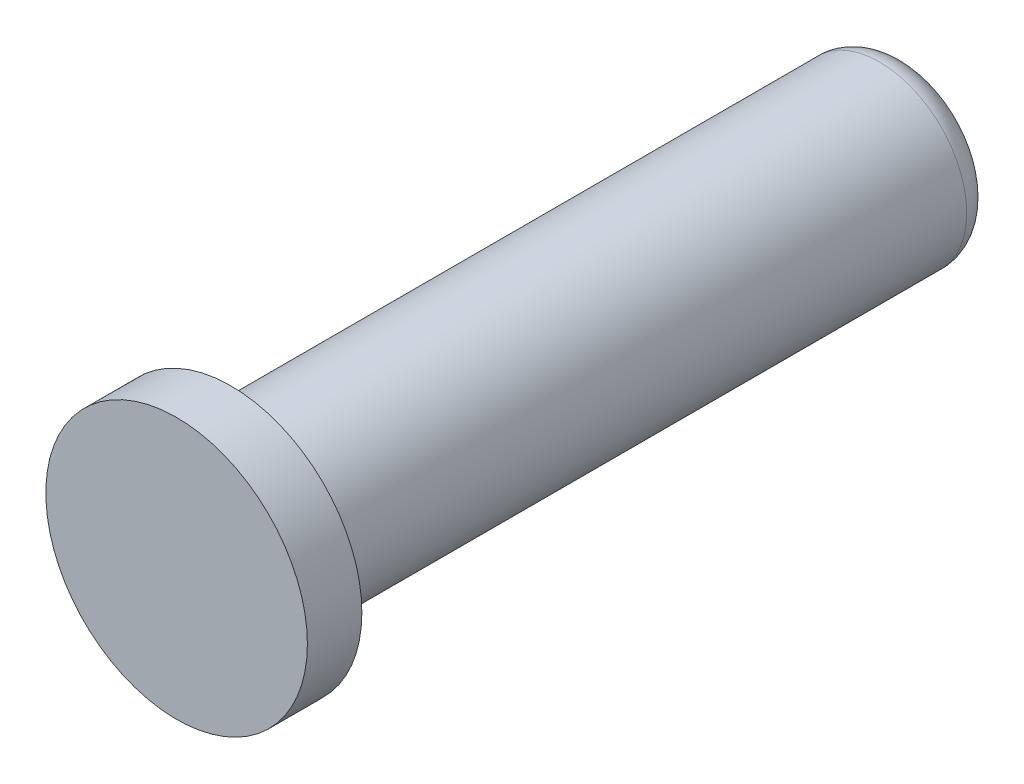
ISO-10303-21;
HEADER;
FILE_DESCRIPTION(('STEP AP214'),'2;1');
FILE_NAME('part.step','',(''),(''),'','','');
FILE_SCHEMA(('AUTOMOTIVE_DESIGN { 1 0 10303 214 1 1 1 1 }'));
ENDSEC;
DATA;
#1=APPLICATION_CONTEXT('core data for automotive mechanical design processes');
#2=APPLICATION_PROTOCOL_DEFINITION('international standard','automotive_design',2000,#1);
#3=PRODUCT_CONTEXT('',#1,'mechanical');
#4=PRODUCT('Part','Part','',(#3));
#5=PRODUCT_RELATED_PRODUCT_CATEGORY('part','',(#4));
#6=PRODUCT_DEFINITION_FORMATION('','',#4);
#7=PRODUCT_DEFINITION_CONTEXT('part definition',#1,'design');
#8=PRODUCT_DEFINITION('design','',#6,#7);
#9=PRODUCT_DEFINITION_SHAPE('','',#8);
#10=(LENGTH_UNIT() NAMED_UNIT(*) SI_UNIT(.MILLI.,.METRE.));
#11=(NAMED_UNIT(*) PLANE_ANGLE_UNIT() SI_UNIT($,.RADIAN.));
#12=(NAMED_UNIT(*) SI_UNIT($,.STERADIAN.) SOLID_ANGLE_UNIT());
#13=UNCERTAINTY_MEASURE_WITH_UNIT(LENGTH_MEASURE(1.E-05),#10,'distance_accuracy_value','');
#14=(GEOMETRIC_REPRESENTATION_CONTEXT(3) GLOBAL_UNCERTAINTY_ASSIGNED_CONTEXT((#13)) GLOBAL_UNIT_ASSIGNED_CONTEXT((#10,
#11,#12)) REPRESENTATION_CONTEXT('',''));
#15=CARTESIAN_POINT('',(0.,0.,0.));
#16=DIRECTION('',(0.,0.,1.));
#17=DIRECTION('',(1.,0.,0.));
#18=AXIS2_PLACEMENT_3D('',#15,#16,#17);
#19=CARTESIAN_POINT('',(0.,0.,0.));
#20=DIRECTION('',(0.,0.,-1.));
#21=DIRECTION('',(-1.,0.,0.));
#22=AXIS2_PLACEMENT_3D('',#19,#20,#21);
#23=PLANE('',#22);
#24=CARTESIAN_POINT('',(0.,0.,0.));
#25=DIRECTION('',(0.,0.,1.));
#26=DIRECTION('',(1.,0.,0.));
#27=AXIS2_PLACEMENT_3D('',#24,#25,#26);
#28=CIRCLE('',#27,12.);
#29=CARTESIAN_POINT('',(12.,0.,0.));
#30=VERTEX_POINT('',#29);
#31=EDGE_CURVE('E12',#30,#30,#28,.T.);
#32=ORIENTED_EDGE('',*,*,#31,.T.);
#33=EDGE_LOOP('',(#32));
#34=FACE_BOUND('',#33,.T.);
#35=ADVANCED_FACE('F33',(#34),#23,.F.);
#36=CARTESIAN_POINT('',(0.,0.,0.));
#37=DIRECTION('',(0.,0.,1.));
#38=DIRECTION('',(1.,0.,0.));
#39=AXIS2_PLACEMENT_3D('',#36,#37,#38);
#40=CYLINDRICAL_SURFACE('',#39,12.);
#41=ORIENTED_EDGE('',*,*,#31,.F.);
#42=EDGE_LOOP('',(#41));
#43=FACE_BOUND('',#42,.T.);
#44=CARTESIAN_POINT('',(0.,0.,-5.));
#45=DIRECTION('',(0.,0.,1.));
#46=DIRECTION('',(1.,0.,0.));
#47=AXIS2_PLACEMENT_3D('',#44,#45,#46);
#48=CIRCLE('',#47,12.);
#49=CARTESIAN_POINT('',(12.,0.,-5.));
#50=VERTEX_POINT('',#49);
#51=EDGE_CURVE('E39',#50,#50,#48,.T.);
#52=ORIENTED_EDGE('',*,*,#51,.T.);
#53=EDGE_LOOP('',(#52));
#54=FACE_BOUND('',#53,.T.);
#55=ADVANCED_FACE('F70',(#43,#54),#40,.T.);
#56=CARTESIAN_POINT('',(0.,12.,-5.));
#57=DIRECTION('',(0.,0.,1.));
#58=DIRECTION('',(1.,0.,0.));
#59=AXIS2_PLACEMENT_3D('',#56,#57,#58);
#60=PLANE('',#59);
#61=ORIENTED_EDGE('',*,*,#51,.F.);
#62=EDGE_LOOP('',(#61));
#63=FACE_BOUND('',#62,.T.);
#64=CARTESIAN_POINT('',(0.,0.,-5.));
#65=DIRECTION('',(0.,0.,1.));
#66=DIRECTION('',(1.,0.,0.));
#67=AXIS2_PLACEMENT_3D('',#64,#65,#66);
#68=CIRCLE('',#67,8.);
#69=CARTESIAN_POINT('',(8.,0.,-5.));
#70=VERTEX_POINT('',#69);
#71=EDGE_CURVE('E65',#70,#70,#68,.T.);
#72=ORIENTED_EDGE('',*,*,#71,.T.);
#73=EDGE_LOOP('',(#72));
#74=FACE_BOUND('',#73,.T.);
#75=ADVANCED_FACE('F72',(#63,#74),#60,.F.);
#76=CARTESIAN_POINT('',(0.,0.,0.));
#77=DIRECTION('',(0.,0.,1.));
#78=DIRECTION('',(1.,0.,0.));
#79=AXIS2_PLACEMENT_3D('',#76,#77,#78);
#80=CYLINDRICAL_SURFACE('',#79,8.);
#81=ORIENTED_EDGE('',*,*,#71,.F.);
#82=EDGE_LOOP('',(#81));
#83=FACE_BOUND('',#82,.T.);
#84=CARTESIAN_POINT('',(0.,0.,-64.5));
#85=DIRECTION('',(0.,0.,1.));
#86=DIRECTION('',(1.,0.,0.));
#87=AXIS2_PLACEMENT_3D('',#84,#85,#86);
#88=CIRCLE('',#87,8.);
#89=CARTESIAN_POINT('',(8.,0.,-64.5));
#90=VERTEX_POINT('',#89);
#91=EDGE_CURVE('E62',#90,#90,#88,.T.);
#92=ORIENTED_EDGE('',*,*,#91,.T.);
#93=EDGE_LOOP('',(#92));
#94=FACE_BOUND('',#93,.T.);
#95=ADVANCED_FACE('F75',(#83,#94),#80,.T.);
#96=CARTESIAN_POINT('',(0.,0.,-64.5));
#97=DIRECTION('',(0.,0.,1.));
#98=DIRECTION('',(1.,0.,0.));
#99=AXIS2_PLACEMENT_3D('',#96,#97,#98);
#100=TOROIDAL_SURFACE('',#99,5.5,2.5);
#101=ORIENTED_EDGE('',*,*,#91,.F.);
#102=EDGE_LOOP('',(#101));
#103=FACE_BOUND('',#102,.T.);
#104=CARTESIAN_POINT('',(0.,0.,-67.));
#105=DIRECTION('',(0.,0.,1.));
#106=DIRECTION('',(1.,0.,0.));
#107=AXIS2_PLACEMENT_3D('',#104,#105,#106);
#108=CIRCLE('',#107,5.5);
#109=CARTESIAN_POINT('',(5.5,0.,-67.));
#110=VERTEX_POINT('',#109);
#111=EDGE_CURVE('E59',#110,#110,#108,.T.);
#112=ORIENTED_EDGE('',*,*,#111,.T.);
#113=EDGE_LOOP('',(#112));
#114=FACE_BOUND('',#113,.T.);
#115=ADVANCED_FACE('F81',(#103,#114),#100,.T.);
#116=CARTESIAN_POINT('',(0.,5.5,-67.));
#117=DIRECTION('',(0.,0.,1.));
#118=DIRECTION('',(1.,0.,0.));
#119=AXIS2_PLACEMENT_3D('',#116,#117,#118);
#120=PLANE('',#119);
#121=CARTESIAN_POINT('',(0.,0.,-67.));
#122=DIRECTION('',(0.,0.,-1.));
#123=DIRECTION('',(0.,1.,0.));
#124=AXIS2_PLACEMENT_3D('',#121,#122,#123);
#125=CIRCLE('',#124,3.);
#126=CARTESIAN_POINT('',(0.,3.00000000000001,-67.));
#127=VERTEX_POINT('',#126);
#128=EDGE_CURVE('E54',#127,#127,#125,.T.);
#129=ORIENTED_EDGE('',*,*,#128,.F.);
#130=EDGE_LOOP('',(#129));
#131=FACE_BOUND('',#130,.T.);
#132=ORIENTED_EDGE('',*,*,#111,.F.);
#133=EDGE_LOOP('',(#132));
#134=FACE_BOUND('',#133,.T.);
#135=ADVANCED_FACE('F87',(#131,#134),#120,.F.);
#136=CARTESIAN_POINT('',(0.,0.,-67.));
#137=DIRECTION('',(0.,0.,-1.));
#138=DIRECTION('',(0.,1.,0.));
#139=AXIS2_PLACEMENT_3D('',#136,#137,#138);
#140=CONICAL_SURFACE('',#139,3.,0.785398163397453);
#141=CARTESIAN_POINT('',(0.,0.,-66.5));
#142=DIRECTION('',(0.,0.,-1.));
#143=DIRECTION('',(0.,1.,0.));
#144=AXIS2_PLACEMENT_3D('',#141,#142,#143);
#145=CIRCLE('',#144,2.5);
#146=CARTESIAN_POINT('',(0.,2.5,-66.5));
#147=VERTEX_POINT('',#146);
#148=EDGE_CURVE('E51',#147,#147,#145,.T.);
#149=ORIENTED_EDGE('',*,*,#148,.F.);
#150=EDGE_LOOP('',(#149));
#151=FACE_BOUND('',#150,.T.);
#152=ORIENTED_EDGE('',*,*,#128,.T.);
#153=EDGE_LOOP('',(#152));
#154=FACE_BOUND('',#153,.T.);
#155=ADVANCED_FACE('F92',(#151,#154),#140,.F.);
#156=CARTESIAN_POINT('',(0.,0.,-67.));
#157=DIRECTION('',(0.,0.,-1.));
#158=DIRECTION('',(0.,1.,0.));
#159=AXIS2_PLACEMENT_3D('',#156,#157,#158);
#160=CYLINDRICAL_SURFACE('',#159,2.5);
#161=CARTESIAN_POINT('',(0.,0.,-61.));
#162=DIRECTION('',(0.,0.,-1.));
#163=DIRECTION('',(0.,1.,0.));
#164=AXIS2_PLACEMENT_3D('',#161,#162,#163);
#165=CIRCLE('',#164,2.5);
#166=CARTESIAN_POINT('',(0.,2.5,-61.));
#167=VERTEX_POINT('',#166);
#168=EDGE_CURVE('E49',#167,#167,#165,.T.);
#169=ORIENTED_EDGE('',*,*,#168,.F.);
#170=EDGE_LOOP('',(#169));
#171=FACE_BOUND('',#170,.T.);
#172=ORIENTED_EDGE('',*,*,#148,.T.);
#173=EDGE_LOOP('',(#172));
#174=FACE_BOUND('',#173,.T.);
#175=ADVANCED_FACE('F45',(#171,#174),#160,.F.);
#176=CARTESIAN_POINT('',(0.,0.,-61.));
#177=DIRECTION('',(0.,0.,-1.));
#178=DIRECTION('',(0.,1.,0.));
#179=AXIS2_PLACEMENT_3D('',#176,#177,#178);
#180=CONICAL_SURFACE('',#179,2.5,1.18682389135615);
#181=CARTESIAN_POINT('',(0.,0.,-59.9899344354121));
#182=VERTEX_POINT('',#181);
#183=VERTEX_LOOP('',#182);
#184=FACE_BOUND('',#183,.T.);
#185=ORIENTED_EDGE('',*,*,#168,.T.);
#186=EDGE_LOOP('',(#185));
#187=FACE_BOUND('',#186,.T.);
#188=ADVANCED_FACE('F42',(#184,#187),#180,.F.);
#189=CLOSED_SHELL('',(#35,#55,#75,#95,#115,#135,#155,#175,#188));
#190=MANIFOLD_SOLID_BREP('B2',#189);
#191=ADVANCED_BREP_SHAPE_REPRESENTATION('',(#18,#190),#14);
#192=SHAPE_DEFINITION_REPRESENTATION(#9,#191);
ENDSEC;
END-ISO-10303-21;
